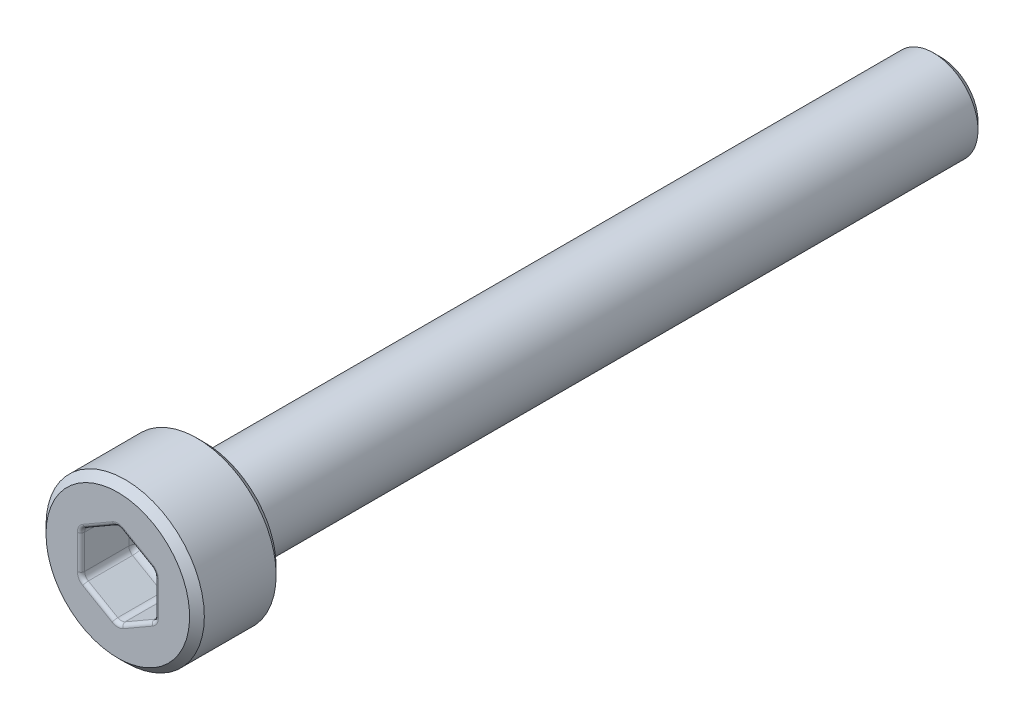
from build123d import *

# Parameters (mm, degrees)
SCHNITT_LINEAR_AUSTRAGEN1_DEPTH = 1.5
FASE1_SIZE                      = 0.2
VERRUNDUNG1_R                   = 0.2
VERRUNDUNG2_R                   = 0.1


with BuildPart() as part:
    # Skizze1 → Rotation1 (revolve)
    with BuildSketch(Plane(origin=(0, 0, 0), x_dir=(0, 0, -1), z_dir=(1, 0, 0)), mode=Mode.PRIVATE) as rotation1_sk:
        Polygon((-2.35, 0), (-2.35, 2.15), (0, 2.15), (0, 1.21), (20, 1.21), (20, 0), align=None)
    revolve(rotation1_sk.sketch.rotate(Axis((0, 0, 21.919879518), (0, 0, -1)), 90), axis=Axis((0, 0, 21.919879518), (0, 0, -1)))

    # Skizze2 → Schnitt-Linear austragen1 (cut)
    with BuildSketch(Plane.XY.offset(2.35)):
        Polygon((1, -0.577350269), (1, 0.577350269), (0, 1.154700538), (-1, 0.577350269), (-1, -0.577350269), (0, -1.154700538), align=None)
    extrude(amount=-SCHNITT_LINEAR_AUSTRAGEN1_DEPTH, mode=Mode.SUBTRACT)

    # Fase1
    fase1_edges = [part.edges().sort_by_distance(p)[0] for p in [
        (-1.21, 0, -20),
        (-2.15, 0, 0),
        (-2.15, 0, 2.35),
    ]]
    chamfer(fase1_edges, length=FASE1_SIZE)

    # Verrundung1
    verrundung1_edges = [part.edges().sort_by_distance(p)[0] for p in [
        (0.5, -0.866025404, 0.85),
        (1, -0.577350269, 1.6),
        (-0.5, -0.866025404, 0.85),
        (0, -1.154700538, 1.6),
        (-1, 0, 0.85),
        (-1, -0.577350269, 1.6),
        (-0.5, 0.866025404, 0.85),
        (-1, 0.577350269, 1.6),
        (0.5, 0.866025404, 0.85),
        (0, 1.154700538, 1.6),
        (1, 0, 0.85),
        (1, 0.577350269, 1.6),
        (-1.21, 0, 0),
    ]]
    fillet(verrundung1_edges, radius=VERRUNDUNG1_R)

    # Verrundung2
    verrundung2_edges = [part.edges().sort_by_distance(p)[0] for p in [
        (-0.5, -0.866025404, 2.35),
        (-1, 0, 2.35),
        (-0.5, 0.866025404, 2.35),
        (0.5, 0.866025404, 2.35),
        (1, 0, 2.35),
        (0.5, -0.866025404, 2.35),
        (-0.973205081, -0.561880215, 2.35),
        (0, -1.123760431, 2.35),
        (0.973205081, -0.561880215, 2.35),
        (0.973205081, 0.561880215, 2.35),
        (0, 1.123760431, 2.35),
        (-0.973205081, 0.561880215, 2.35),
    ]]
    fillet(verrundung2_edges, radius=VERRUNDUNG2_R)


solid = part.part
